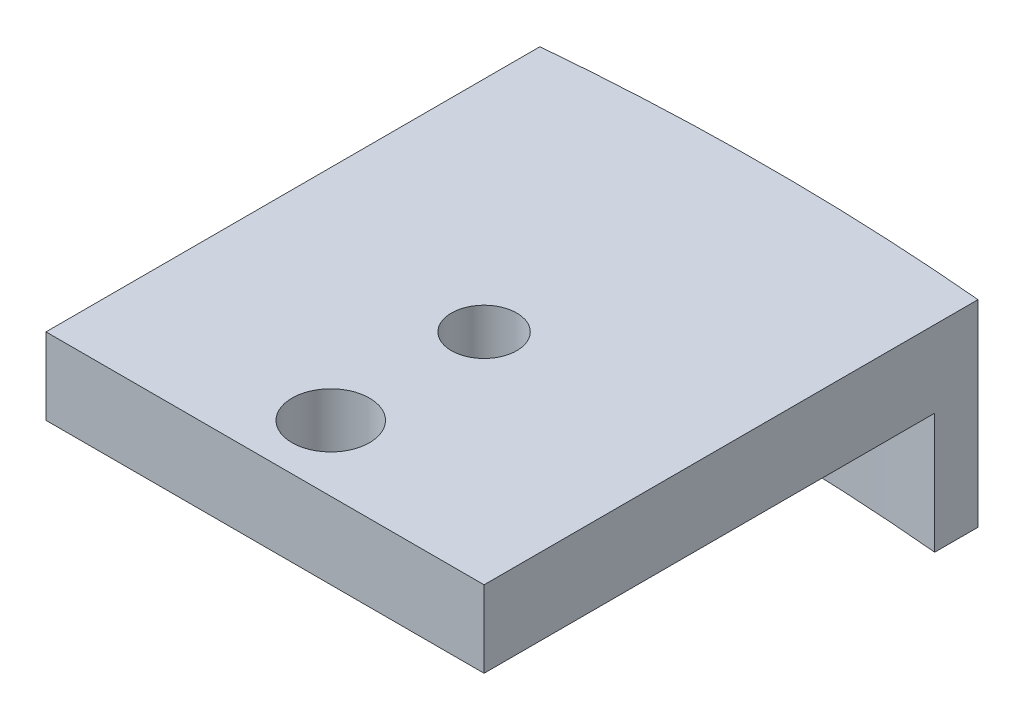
from build123d import *

# Parameters (mm, degrees)
BASE_EXTRUDE_DEPTH  = 5.55625
BOSS_EXTRUDE1_START = -8.73125
BOSS_EXTRUDE1_DEPTH = 8.73125
HOLE1_D             = 4.365625
HOLE1_DEPTH         = 203.2
HOLE1_CBORE_D       = 4.7371
HOLE1_CBORE_DEPTH   = 14.2875
F_10_OV_DR1_D       = 5.6134
F_10_OV_DR1_DEPTH   = 203.2


with BuildPart() as part:
    # Sketch1 → Base-Extrude (new body)
    with BuildSketch(Plane(origin=(0, 1213.64375, 0), x_dir=(-1, 0, 0), z_dir=(0, 1, 0))):
        with BuildLine():
            Line((15.875, -175.495953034), (15.875, -139.7))
            Line((15.875, -139.7), (-15.875, -139.7))
            Line((-15.875, -139.7), (-15.875, -175.495953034))
            ThreePointArc((-15.875, -175.495953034), (0, -176.2125), (15.875, -175.495953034))
        make_face()
    extrude(amount=BASE_EXTRUDE_DEPTH)

    # Sketch2 → Boss-Extrude1 (add)
    with BuildSketch(Plane(origin=(0, 1213.64375, 0), x_dir=(-1, 0, 0), z_dir=(0, 1, 0)).offset(BOSS_EXTRUDE1_START)):
        with BuildLine():
            Line((-15.875, -172.358765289), (-15.875, -175.495953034))
            ThreePointArc((-15.875, -175.495953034), (0, -176.2125), (15.875, -175.495953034))
            Line((15.875, -175.495953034), (15.875, -172.358765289))
            ThreePointArc((15.875, -172.358765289), (0, -173.0883), (-15.875, -172.358765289))
        make_face()
    extrude(amount=BOSS_EXTRUDE1_DEPTH)

    # Hole1
    with Locations(Plane(origin=(-9.065742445, 1219.2, -134.199545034), x_dir=(-1, 0, 0), z_dir=(0, 1, 0))):
        with Locations((-9.065742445, -21.375454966)):
            CounterBoreHole(HOLE1_D / 2, HOLE1_CBORE_D / 2, HOLE1_CBORE_DEPTH, depth=HOLE1_DEPTH)

    # 10-OV-DR1
    with Locations(Plane(origin=(0.39263522, 1219.2, -145.375143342), x_dir=(-1, 0, 0), z_dir=(0, 1, 0))):
        with Locations((0.39263522, 0.912643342)):
            Hole(F_10_OV_DR1_D / 2, depth=F_10_OV_DR1_DEPTH)


solid = part.part
